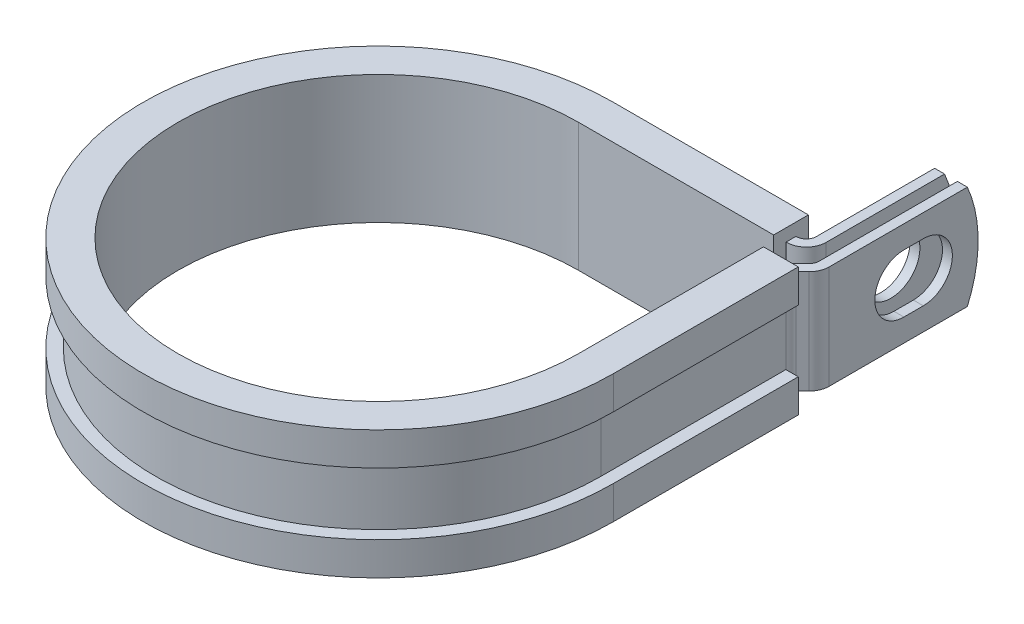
from build123d import *

# Parameters (mm, degrees)
EXTRUDE_THIN1_DEPTH = 6.35
SKETCH2_R           = 3.5687
CUT_EXTRUDE1_DEPTH  = 1.2192
CUT_EXTRUDE2_DEPTH  = 1.2192
CUT_EXTRUDE3_DEPTH  = 70.119620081


with BuildPart() as part:
    # Sketch1 → Extrude-Thin1 (new, symmetric)
    with BuildSketch(Plane(origin=(0, 0, 0), x_dir=(1, 0, 0), z_dir=(0, 1, 0))):
        with BuildLine():
            Line((28.0213698, 44.4246), (28.0213698, 26.1239))
            ThreePointArc((28.0213698, 26.1239), (27.928563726, 25.657332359), (27.664274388, 25.261795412))
            Line((27.664274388, 25.261795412), (26.838090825, 24.435611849))
            ThreePointArc((26.838090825, 24.435611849), (26.309512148, 23.644537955), (26.1239, 22.711402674))
            Line((26.1239, 22.711402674), (26.1239, 0))
            ThreePointArc((26.1239, 0), (-18.472386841, -18.472386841), (0, 26.1239))
            Line((0, 26.1239), (24.0081698, 26.1239))
            ThreePointArc((24.0081698, 26.1239), (25.732378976, 26.838090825), (26.4465698, 28.5623))
            Line((26.4465698, 28.5623), (26.4465698, 44.4246))
            Line((26.4465698, 44.4246), (25.2273698, 44.4246))
            Line((25.2273698, 44.4246), (25.2273698, 28.5623))
            ThreePointArc((25.2273698, 28.5623), (24.870274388, 27.700195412), (24.0081698, 27.3431))
            Line((24.0081698, 27.3431), (0, 27.3431))
            ThreePointArc((0, 27.3431), (-19.334491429, -19.334491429), (27.3431, 0))
            Line((27.3431, 0), (27.3431, 22.711402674))
            ThreePointArc((27.3431, 22.711402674), (27.435906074, 23.177970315), (27.700195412, 23.573507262))
            Line((27.700195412, 23.573507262), (28.526378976, 24.399690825))
            ThreePointArc((28.526378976, 24.399690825), (29.054957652, 25.190764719), (29.2405698, 26.1239))
            Line((29.2405698, 26.1239), (29.2405698, 44.4246))
            Line((29.2405698, 44.4246), (28.0213698, 44.4246))
        make_face()
    extrude(amount=EXTRUDE_THIN1_DEPTH, both=True)

    # Sketch2 → Cut-Extrude1 (cut)
    with BuildSketch(Plane.ZY.offset(-25.2273698)):
        with Locations((-36.4998, 0)):
            Circle(SKETCH2_R)
    extrude(amount=-CUT_EXTRUDE1_DEPTH, mode=Mode.SUBTRACT)

    # Sketch3 → Cut-Extrude2 (cut)
    with BuildSketch(Plane(origin=(29.2405698, 0, 0), x_dir=(0, 0, -1), z_dir=(1, 0, 0))):
        with BuildLine():
            Line((35.306, 3.5687), (37.6936, 3.5687))
            ThreePointArc((37.6936, 3.5687), (41.2623, 0), (37.6936, -3.5687))
            Line((37.6936, -3.5687), (35.306, -3.5687))
            ThreePointArc((35.306, -3.5687), (31.7373, 0), (35.306, 3.5687))
        make_face()
    extrude(amount=-CUT_EXTRUDE2_DEPTH, mode=Mode.SUBTRACT)

    # Sketch4 → Cut-Extrude3 (cut, through all)
    with BuildSketch(Plane.ZY.offset(-25.2273698)):
        with BuildLine():
            Line((-43.099277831, 6.35), (-44.4246, 6.35))
            Line((-44.4246, 6.35), (-44.4246, 0))
            ThreePointArc((-44.4246, 0), (-44.089737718, 3.243415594), (-43.099277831, 6.35))
        make_face()
        with BuildLine():
            ThreePointArc((-43.099277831, -6.35), (-44.089737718, -3.243415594), (-44.4246, 0))
            Line((-44.4246, 0), (-44.4246, -6.35))
            Line((-44.4246, -6.35), (-43.099277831, -6.35))
        make_face()
    extrude(amount=-CUT_EXTRUDE3_DEPTH, mode=Mode.SUBTRACT)

    # Sweep1: sweep along a path in Sketch6
    with BuildLine(Plane(origin=(0, 6.35, 0), x_dir=(1, 0, 0), z_dir=(0, 1, 0))) as sweep1_path:
        Line((24.5999, 22.711402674), (24.5999, 0))
        ThreePointArc((24.5999, 0), (-17.394756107, -17.394756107), (0, 24.5999))
        Line((0, 24.5999), (23.9573698, 24.5999))
    # Sketch5 → Sweep1 (sweep)
    with BuildSketch(Plane(origin=(0, 0, -22.711402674), x_dir=(-1, 0, 0), z_dir=(0, 0, -1))):
        Polygon((-27.3431, 6.35), (-26.1239, 6.35), (-26.1239, -6.35), (-27.3431, -6.35), (-27.3431, -3.81), (-28.8671, -3.81), (-28.8671, -7.874), (-24.5999, -7.874), (-24.5999, 7.874), (-28.8671, 7.874), (-28.8671, 3.81), (-27.3431, 3.81), align=None)
    sweep(path=sweep1_path.line)


solid = part.part
